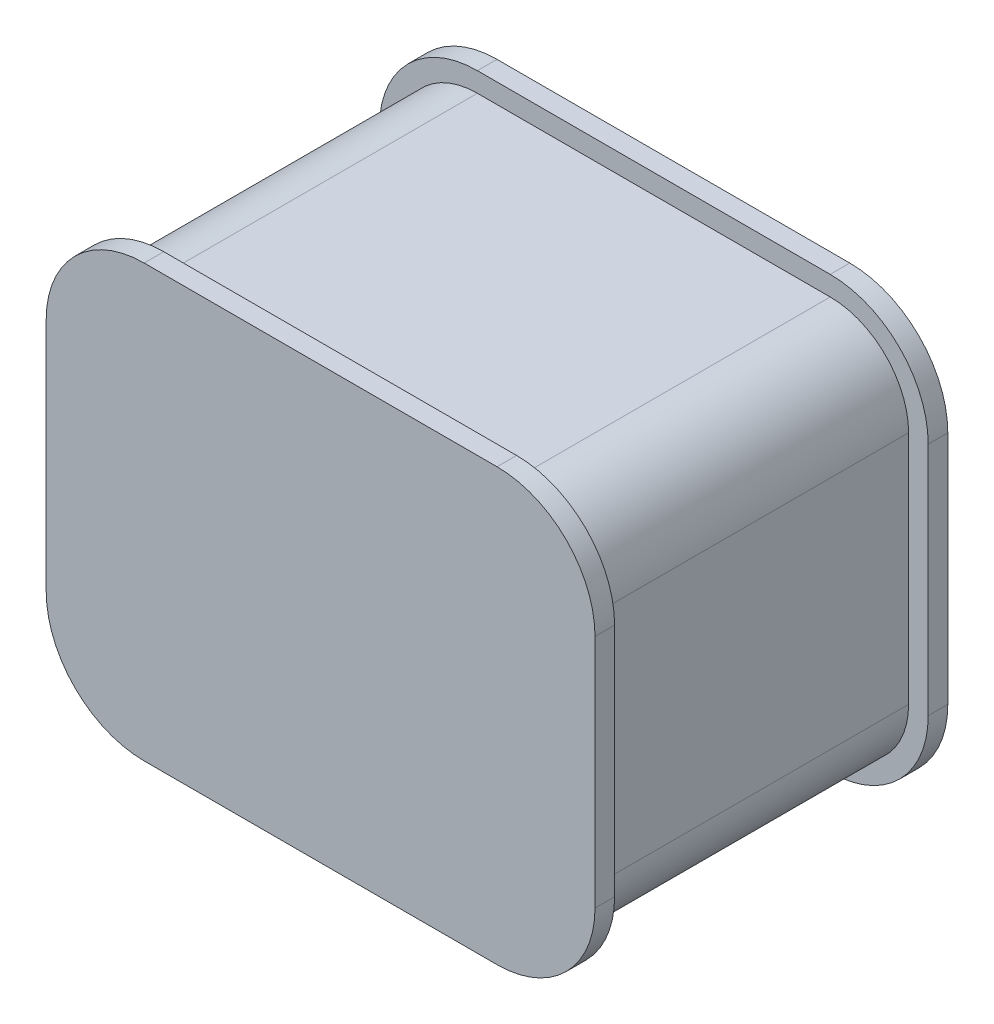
from build123d import *

# Parameters (mm, degrees)
BASIS_LINEAR_AUSTRAGEN_DEPTH = 40
LINEAR_AUSTRAGEN1_DEPTH      = 5


with BuildPart() as part:
    # Skizze1 → Basis-Linear austragen (new body)
    with BuildSketch(Plane.XY):
        with BuildLine():
            Line((-45, 50), (45, 50))
            ThreePointArc((45, 50), (59.142135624, 44.142135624), (65, 30))
            Line((65, 30), (65, -30))
            ThreePointArc((65, -30), (59.142135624, -44.142135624), (45, -50))
            Line((45, -50), (-45, -50))
            ThreePointArc((-45, -50), (-59.142135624, -44.142135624), (-65, -30))
            Line((-65, -30), (-65, 30))
            ThreePointArc((-65, 30), (-59.142135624, 44.142135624), (-45, 50))
        make_face()
    extrude(amount=BASIS_LINEAR_AUSTRAGEN_DEPTH)

    # Skizze2 → Linear austragen1 (add)
    with BuildSketch(Plane.XY.offset(40)):
        with BuildLine():
            Line((-70, 30), (-70, -30))
            ThreePointArc((-70, -30), (-62.67766953, -47.67766953), (-45, -55))
            Line((-45, -55), (45, -55))
            ThreePointArc((45, -55), (62.67766953, -47.67766953), (70, -30))
            Line((70, -30), (70, 30))
            ThreePointArc((70, 30), (62.67766953, 47.67766953), (45, 55))
            Line((45, 55), (-45, 55))
            ThreePointArc((-45, 55), (-62.67766953, 47.67766953), (-70, 30))
        make_face()
    extrude(amount=LINEAR_AUSTRAGEN1_DEPTH)

    # Spiegeln1: part across plane


with BuildPart() as part_1:
    add(part.part)
    add(part.part.mirror(Plane(origin=(-45, 30, 0), x_dir=(1, 0, 0), z_dir=(0, 0, 1))))


solid = part_1.part
